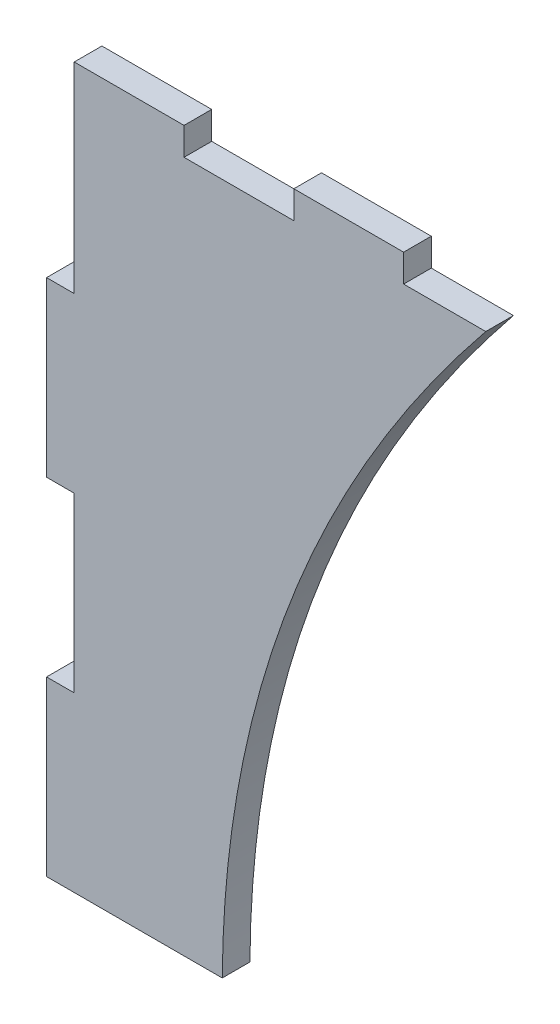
from build123d import *

# Parameters (mm, degrees)
BOSS_EXTRUDE1_DEPTH = 16


with BuildPart() as part:
    # Sketch2 → Boss-Extrude1 (new body)
    with BuildSketch(Plane.XY):
        with BuildLine():
            Line((0, 300), (0, 200))
            Line((0, 200), (16, 200))
            Line((16, 200), (16, 100))
            Line((16, 100), (0, 100))
            Line((0, 100), (0, 0))
            Line((0, 0), (101.6, 0))
            add(Edge.make_bspline(
                [(254, 400), (103.225203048, 213.725277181), (101.6, 0)],
                knots=[0, 0, 0, 0.978671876, 0.978671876, 0.978671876], degree=2))
            Line((254, 400), (206.5, 400))
            Line((206.5, 400), (206.5, 416))
            Line((206.5, 416), (143, 416))
            Line((143, 416), (143, 400))
            Line((143, 400), (79.5, 400))
            Line((79.5, 400), (79.5, 416))
            Line((79.5, 416), (16, 416))
            Line((16, 416), (16, 300))
            Line((16, 300), (0, 300))
        make_face()
    extrude(amount=BOSS_EXTRUDE1_DEPTH)


solid = part.part
